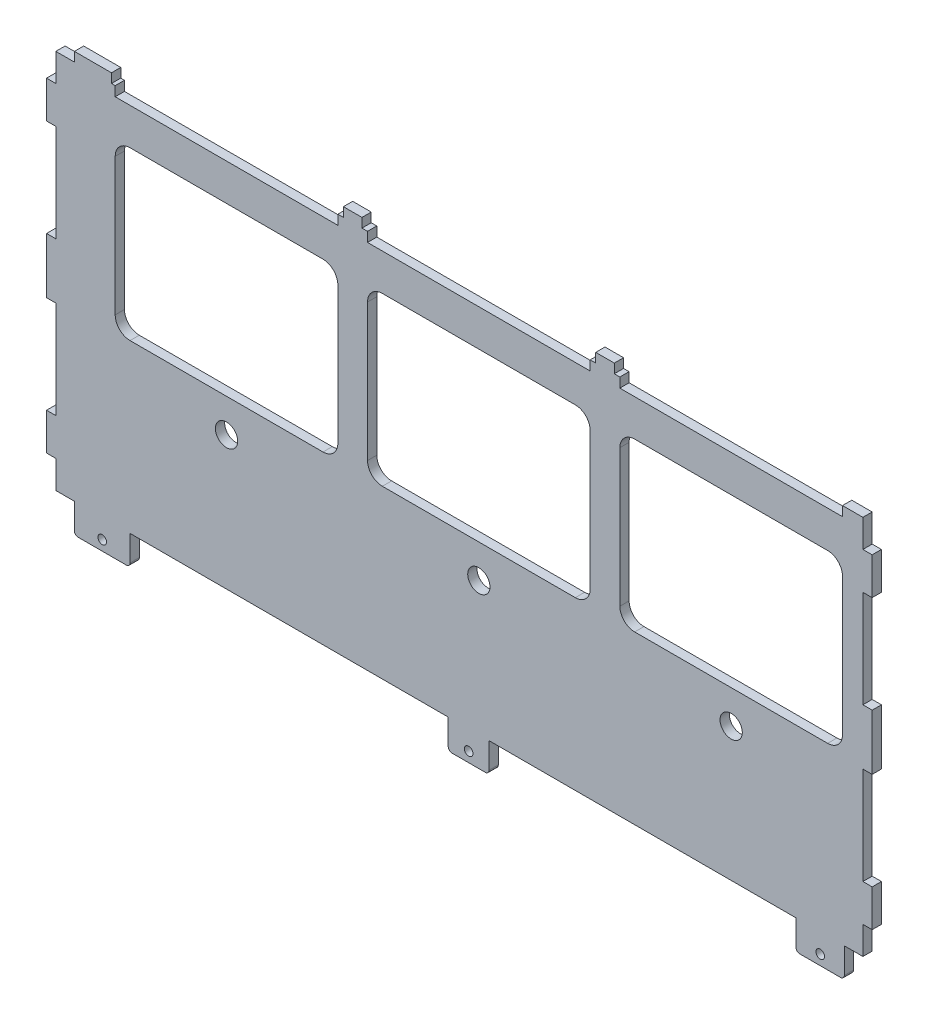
from build123d import *

# Parameters (mm, degrees)
SKETCH1_R             = 3.81
SKETCH1_W             = 76.2
SKETCH1_H             = 57.15
BOSS_EXTRUDE1_DEPTH   = 3.175
FILLET1_R             = 5.08
SKETCH2_W             = 6.35
SKETCH2_H             = 3.175
SKETCH2_W_2           = 3.175
SKETCH2_H_2           = 12.7
SKETCH2_H_3           = 19.05
SKETCH2_W_3           = 19.05
SKETCH2_H_4           = 10.033
SKETCH2_W_4           = 13.97
SKETCH2_W_5           = 16.51
SKETCH2_W_6           = 12.7
BOSS_EXTRUDE2_DEPTH   = 3.175
F_4_CLEARANCE_HOLE1_D = 2.9464
FILLET2_R             = 1.27


with BuildPart() as part:
    # Sketch1 → Boss-Extrude1 (new body)
    with BuildSketch(Plane.XY):
        Polygon((0, 0), (276.225, 0), (276.225, 130.175), (269.24, 130.175), (269.24, 126.873), (193.04, 126.873), (193.04, 130.175), (182.88, 130.175), (182.88, 126.873), (106.68, 126.873), (106.68, 130.175), (96.52, 130.175), (96.52, 126.873), (20.32, 126.873), (20.32, 130.175), (0, 130.175), align=None)
        with Locations((231.14, 45.72)):
            Circle(SKETCH1_R, mode=Mode.SUBTRACT)
        with Locations((58.42, 45.72)):
            Circle(SKETCH1_R, mode=Mode.SUBTRACT)
        with Locations(Location((144.78, 45.72, 0), (0, 0, 180))):
            Circle(SKETCH1_R, mode=Mode.SUBTRACT)
        with Locations((144.78, 85.725)):
            Rectangle(SKETCH1_W, SKETCH1_H, mode=Mode.SUBTRACT)
        with Locations((58.42, 85.725)):
            Rectangle(SKETCH1_W, SKETCH1_H, mode=Mode.SUBTRACT)
        with Locations((231.14, 85.725)):
            Rectangle(SKETCH1_W, SKETCH1_H, mode=Mode.SUBTRACT)
    extrude(amount=BOSS_EXTRUDE1_DEPTH)

    # Fillet1
    fillet1_edges = [part.edges().sort_by_distance(p)[0] for p in [
        (20.32, 114.3, 1.5875),
        (20.32, 57.15, 1.5875),
        (96.52, 57.15, 1.5875),
        (96.52, 114.3, 1.5875),
        (182.88, 114.3, 1.5875),
        (106.68, 114.3, 1.5875),
        (106.68, 57.15, 1.5875),
        (182.88, 57.15, 1.5875),
        (269.24, 114.3, 1.5875),
        (193.04, 114.3, 1.5875),
        (193.04, 57.15, 1.5875),
        (269.24, 57.15, 1.5875),
    ]]
    fillet(fillet1_edges, radius=FILLET1_R)

    # Sketch2 → Boss-Extrude2 (add)
    with BuildSketch(Plane.XY):
        with Locations((187.96, 131.7625)):
            Rectangle(SKETCH2_W, SKETCH2_H)
        with Locations((277.8125, 114.3)):
            Rectangle(SKETCH2_W_2, SKETCH2_H_2)
        with Locations((277.8125, 15.875)):
            Rectangle(SKETCH2_W_2, SKETCH2_H_2)
        with Locations((-1.5875, 65.0875)):
            Rectangle(SKETCH2_W_2, SKETCH2_H_3)
        with Locations((277.8125, 65.0875)):
            Rectangle(SKETCH2_W_2, SKETCH2_H_3)
        with Locations((-1.5875, 15.875)):
            Rectangle(SKETCH2_W_2, SKETCH2_H_2)
        with Locations((-1.5875, 114.3)):
            Rectangle(SKETCH2_W_2, SKETCH2_H_2)
        with Locations((15.875, -5.0165)):
            Rectangle(SKETCH2_W_3, SKETCH2_H_4)
        with Locations((141.2875, -5.0165)):
            Rectangle(SKETCH2_W_4, SKETCH2_H_4)
        with Locations((261.62, -5.0165)):
            Rectangle(SKETCH2_W_5, SKETCH2_H_4)
        with Locations((101.6, 131.7625)):
            Rectangle(SKETCH2_W, SKETCH2_H)
        with Locations((12.7, 131.7625)):
            Rectangle(SKETCH2_W_6, SKETCH2_H)
    extrude(amount=BOSS_EXTRUDE2_DEPTH)

    # 4 Clearance Hole1 (through all)
    with Locations(Plane.XY.offset(3.175)):
        with Locations((141.2875, -6.604), (261.62, -6.604), (15.875, -6.604)):
            Hole(F_4_CLEARANCE_HOLE1_D / 2)

    # Fillet2
    fillet2_edges = [part.edges().sort_by_distance(p)[0] for p in [
        (269.875, -10.033, 1.5875),
        (253.365, -10.033, 1.5875),
        (148.2725, -10.033, 1.5875),
        (134.3025, -10.033, 1.5875),
        (25.4, -10.033, 1.5875),
        (6.35, -10.033, 1.5875),
    ]]
    fillet(fillet2_edges, radius=FILLET2_R)


solid = part.part
